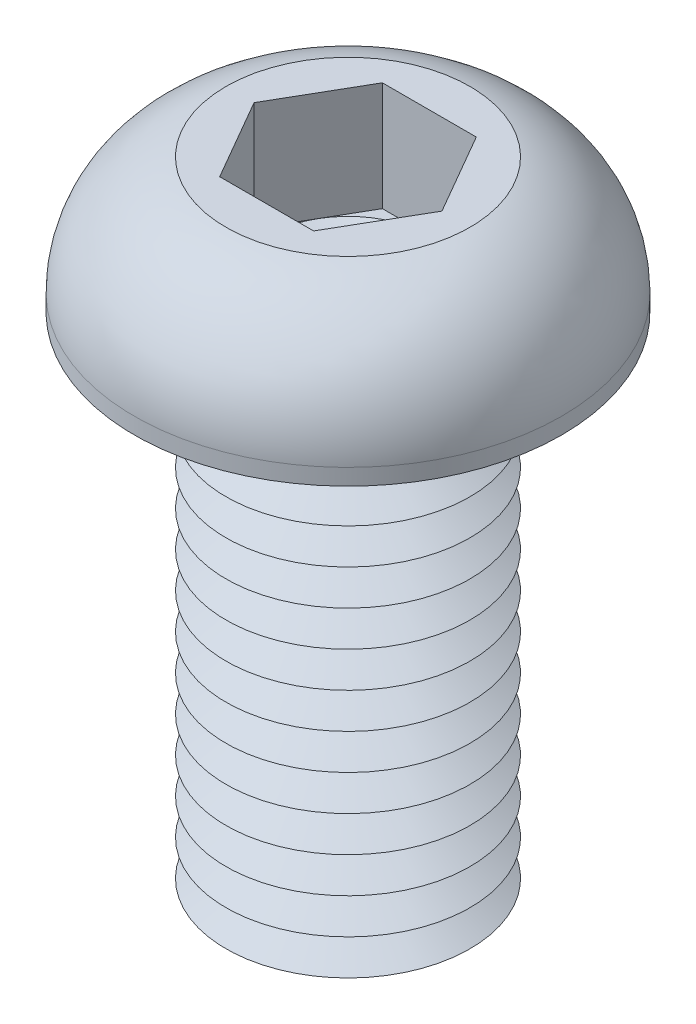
ISO-10303-21;
HEADER;
FILE_DESCRIPTION(('STEP AP214'),'2;1');
FILE_NAME('part.step','',(''),(''),'','','');
FILE_SCHEMA(('AUTOMOTIVE_DESIGN { 1 0 10303 214 1 1 1 1 }'));
ENDSEC;
DATA;
#1=APPLICATION_CONTEXT('core data for automotive mechanical design processes');
#2=APPLICATION_PROTOCOL_DEFINITION('international standard','automotive_design',2000,#1);
#3=PRODUCT_CONTEXT('',#1,'mechanical');
#4=PRODUCT('Part','Part','',(#3));
#5=PRODUCT_RELATED_PRODUCT_CATEGORY('part','',(#4));
#6=PRODUCT_DEFINITION_FORMATION('','',#4);
#7=PRODUCT_DEFINITION_CONTEXT('part definition',#1,'design');
#8=PRODUCT_DEFINITION('design','',#6,#7);
#9=PRODUCT_DEFINITION_SHAPE('','',#8);
#10=(LENGTH_UNIT() NAMED_UNIT(*) SI_UNIT(.MILLI.,.METRE.));
#11=(NAMED_UNIT(*) PLANE_ANGLE_UNIT() SI_UNIT($,.RADIAN.));
#12=(NAMED_UNIT(*) SI_UNIT($,.STERADIAN.) SOLID_ANGLE_UNIT());
#13=UNCERTAINTY_MEASURE_WITH_UNIT(LENGTH_MEASURE(1.E-05),#10,'distance_accuracy_value','');
#14=(GEOMETRIC_REPRESENTATION_CONTEXT(3) GLOBAL_UNCERTAINTY_ASSIGNED_CONTEXT((#13)) GLOBAL_UNIT_ASSIGNED_CONTEXT((#10,
#11,#12)) REPRESENTATION_CONTEXT('',''));
#15=CARTESIAN_POINT('',(0.,0.,0.));
#16=DIRECTION('',(0.,0.,1.));
#17=DIRECTION('',(1.,0.,0.));
#18=AXIS2_PLACEMENT_3D('',#15,#16,#17);
#19=CARTESIAN_POINT('',(0.,0.,0.));
#20=DIRECTION('',(0.,-1.,0.));
#21=DIRECTION('',(0.,0.,-1.));
#22=AXIS2_PLACEMENT_3D('',#19,#20,#21);
#23=TOROIDAL_SURFACE('',#22,6.875,0.875);
#24=CARTESIAN_POINT('',(0.,0.,-7.75));
#25=VERTEX_POINT('',#24);
#26=VERTEX_LOOP('',#25);
#27=FACE_BOUND('',#26,.T.);
#28=ADVANCED_FACE('P0_F12',(#27),#23,.T.);
#29=CLOSED_SHELL('',(#28));
#30=MANIFOLD_SOLID_BREP('P0_B1',#29);
#31=CARTESIAN_POINT('',(2.3094010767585,1.24,-4.));
#32=DIRECTION('',(0.,1.,0.));
#33=DIRECTION('',(0.,0.,1.));
#34=AXIS2_PLACEMENT_3D('',#31,#32,#33);
#35=PLANE('',#34);
#36=CARTESIAN_POINT('',(0.,1.24,0.));
#37=DIRECTION('',(0.,1.,0.));
#38=DIRECTION('',(0.,0.,1.));
#39=AXIS2_PLACEMENT_3D('',#36,#37,#38);
#40=CIRCLE('',#39,4.);
#41=CARTESIAN_POINT('',(0.,1.24,4.));
#42=VERTEX_POINT('',#41);
#43=CARTESIAN_POINT('',(3.46410161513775,1.24,2.));
#44=VERTEX_POINT('',#43);
#45=EDGE_CURVE('P1_E93',#42,#44,#40,.T.);
#46=ORIENTED_EDGE('',*,*,#45,.F.);
#47=DIRECTION('',(1.,0.,0.));
#48=VECTOR('',#47,1.);
#49=CARTESIAN_POINT('',(-2.3094010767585,1.24,4.));
#50=LINE('',#49,#48);
#51=CARTESIAN_POINT('',(2.3094010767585,1.24,4.));
#52=VERTEX_POINT('',#51);
#53=EDGE_CURVE('P1_E116',#42,#52,#50,.T.);
#54=ORIENTED_EDGE('',*,*,#53,.T.);
#55=DIRECTION('',(0.5,0.,-0.866025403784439));
#56=VECTOR('',#55,1.);
#57=CARTESIAN_POINT('',(2.3094010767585,1.24,4.));
#58=LINE('',#57,#56);
#59=EDGE_CURVE('P1_E112',#52,#44,#58,.T.);
#60=ORIENTED_EDGE('',*,*,#59,.T.);
#61=EDGE_LOOP('',(#46,#54,#60));
#62=FACE_BOUND('',#61,.T.);
#63=ADVANCED_FACE('P1_F15',(#62),#35,.T.);
#64=CARTESIAN_POINT('',(0.,1.24,0.));
#65=DIRECTION('',(0.,1.,0.));
#66=DIRECTION('',(0.,0.,1.));
#67=AXIS2_PLACEMENT_3D('',#64,#65,#66);
#68=CIRCLE('',#67,4.);
#69=CARTESIAN_POINT('',(3.46410161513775,1.24,-2.));
#70=VERTEX_POINT('',#69);
#71=EDGE_CURVE('P1_E10',#44,#70,#68,.T.);
#72=ORIENTED_EDGE('',*,*,#71,.F.);
#73=CARTESIAN_POINT('',(4.61880215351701,1.24,0.));
#74=VERTEX_POINT('',#73);
#75=EDGE_CURVE('P1_E104',#44,#74,#58,.T.);
#76=ORIENTED_EDGE('',*,*,#75,.T.);
#77=DIRECTION('',(-0.5,0.,-0.866025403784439));
#78=VECTOR('',#77,1.);
#79=CARTESIAN_POINT('',(4.61880215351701,1.24,0.));
#80=LINE('',#79,#78);
#81=EDGE_CURVE('P1_E107',#74,#70,#80,.T.);
#82=ORIENTED_EDGE('',*,*,#81,.T.);
#83=EDGE_LOOP('',(#72,#76,#82));
#84=FACE_BOUND('',#83,.T.);
#85=ADVANCED_FACE('P1_F103',(#84),#35,.T.);
#86=CARTESIAN_POINT('',(0.,1.24,-4.));
#87=VERTEX_POINT('',#86);
#88=EDGE_CURVE('P1_E24',#70,#87,#68,.T.);
#89=ORIENTED_EDGE('',*,*,#88,.F.);
#90=CARTESIAN_POINT('',(2.3094010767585,1.24,-4.));
#91=VERTEX_POINT('',#90);
#92=EDGE_CURVE('P1_E139',#70,#91,#80,.T.);
#93=ORIENTED_EDGE('',*,*,#92,.T.);
#94=DIRECTION('',(-1.,0.,0.));
#95=VECTOR('',#94,1.);
#96=CARTESIAN_POINT('',(2.3094010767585,1.24,-4.));
#97=LINE('',#96,#95);
#98=EDGE_CURVE('P1_E300',#91,#87,#97,.T.);
#99=ORIENTED_EDGE('',*,*,#98,.T.);
#100=EDGE_LOOP('',(#89,#93,#99));
#101=FACE_BOUND('',#100,.T.);
#102=ADVANCED_FACE('P1_F265',(#101),#35,.T.);
#103=CARTESIAN_POINT('',(-3.46410161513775,1.24,-2.));
#104=VERTEX_POINT('',#103);
#105=EDGE_CURVE('P1_E295',#87,#104,#68,.T.);
#106=ORIENTED_EDGE('',*,*,#105,.F.);
#107=CARTESIAN_POINT('',(-2.3094010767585,1.24,-4.));
#108=VERTEX_POINT('',#107);
#109=EDGE_CURVE('P1_E304',#87,#108,#97,.T.);
#110=ORIENTED_EDGE('',*,*,#109,.T.);
#111=DIRECTION('',(-0.5,0.,0.866025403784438));
#112=VECTOR('',#111,1.);
#113=CARTESIAN_POINT('',(-2.3094010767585,1.24,-4.));
#114=LINE('',#113,#112);
#115=EDGE_CURVE('P1_E299',#108,#104,#114,.T.);
#116=ORIENTED_EDGE('',*,*,#115,.T.);
#117=EDGE_LOOP('',(#106,#110,#116));
#118=FACE_BOUND('',#117,.T.);
#119=ADVANCED_FACE('P1_F279',(#118),#35,.T.);
#120=CARTESIAN_POINT('',(-3.46410161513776,1.24,2.));
#121=VERTEX_POINT('',#120);
#122=EDGE_CURVE('P1_E31',#104,#121,#68,.T.);
#123=ORIENTED_EDGE('',*,*,#122,.F.);
#124=CARTESIAN_POINT('',(-4.61880215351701,1.24,0.));
#125=VERTEX_POINT('',#124);
#126=EDGE_CURVE('P1_E291',#104,#125,#114,.T.);
#127=ORIENTED_EDGE('',*,*,#126,.T.);
#128=DIRECTION('',(0.5,0.,0.866025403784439));
#129=VECTOR('',#128,1.);
#130=CARTESIAN_POINT('',(-4.61880215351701,1.24,0.));
#131=LINE('',#130,#129);
#132=EDGE_CURVE('P1_E294',#125,#121,#131,.T.);
#133=ORIENTED_EDGE('',*,*,#132,.T.);
#134=EDGE_LOOP('',(#123,#127,#133));
#135=FACE_BOUND('',#134,.T.);
#136=ADVANCED_FACE('P1_F270',(#135),#35,.T.);
#137=CARTESIAN_POINT('',(0.,-23.25,0.));
#138=DIRECTION('',(0.,1.,0.));
#139=DIRECTION('',(0.,0.,1.));
#140=AXIS2_PLACEMENT_3D('',#137,#138,#139);
#141=CONICAL_SURFACE('',#140,4.48445554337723,1.0471975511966);
#142=CARTESIAN_POINT('',(0.,-22.375,0.));
#143=DIRECTION('',(0.,-1.,0.));
#144=DIRECTION('',(0.,0.,-1.));
#145=AXIS2_PLACEMENT_3D('',#142,#143,#144);
#146=CIRCLE('',#145,6.);
#147=CARTESIAN_POINT('',(0.,-22.375,-6.));
#148=VERTEX_POINT('',#147);
#149=EDGE_CURVE('P1_E227',#148,#148,#146,.T.);
#150=ORIENTED_EDGE('',*,*,#149,.T.);
#151=EDGE_LOOP('',(#150));
#152=FACE_BOUND('',#151,.T.);
#153=CARTESIAN_POINT('',(0.,-23.25,0.));
#154=DIRECTION('',(0.,-1.,0.));
#155=DIRECTION('',(0.,0.,-1.));
#156=AXIS2_PLACEMENT_3D('',#153,#154,#155);
#157=CIRCLE('',#156,4.48445554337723);
#158=CARTESIAN_POINT('',(0.,-23.25,-4.48445554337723));
#159=VERTEX_POINT('',#158);
#160=EDGE_CURVE('P1_E230',#159,#159,#157,.T.);
#161=ORIENTED_EDGE('',*,*,#160,.F.);
#162=EDGE_LOOP('',(#161));
#163=FACE_BOUND('',#162,.T.);
#164=ADVANCED_FACE('P1_F278',(#152,#163),#141,.T.);
#165=CARTESIAN_POINT('',(0.,-24.125,0.));
#166=DIRECTION('',(0.,-1.,0.));
#167=DIRECTION('',(0.,0.,-1.));
#168=AXIS2_PLACEMENT_3D('',#165,#166,#167);
#169=CONICAL_SURFACE('',#168,6.,1.0471975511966);
#170=ORIENTED_EDGE('',*,*,#160,.T.);
#171=EDGE_LOOP('',(#170));
#172=FACE_BOUND('',#171,.T.);
#173=CARTESIAN_POINT('',(0.,-24.125,0.));
#174=DIRECTION('',(0.,-1.,0.));
#175=DIRECTION('',(0.,0.,-1.));
#176=AXIS2_PLACEMENT_3D('',#173,#174,#175);
#177=CIRCLE('',#176,6.);
#178=CARTESIAN_POINT('',(0.,-24.125,-6.));
#179=VERTEX_POINT('',#178);
#180=EDGE_CURVE('P1_E233',#179,#179,#177,.T.);
#181=ORIENTED_EDGE('',*,*,#180,.F.);
#182=EDGE_LOOP('',(#181));
#183=FACE_BOUND('',#182,.T.);
#184=ADVANCED_FACE('P1_F285',(#172,#183),#169,.T.);
#185=CARTESIAN_POINT('',(0.,-25.,0.));
#186=DIRECTION('',(0.,1.,0.));
#187=DIRECTION('',(0.,0.,1.));
#188=AXIS2_PLACEMENT_3D('',#185,#186,#187);
#189=PLANE('',#188);
#190=CARTESIAN_POINT('',(0.,-25.,0.));
#191=DIRECTION('',(0.,-1.,0.));
#192=DIRECTION('',(0.,0.,-1.));
#193=AXIS2_PLACEMENT_3D('',#190,#191,#192);
#194=CIRCLE('',#193,4.48445554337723);
#195=CARTESIAN_POINT('',(0.,-25.,-4.48445554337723));
#196=VERTEX_POINT('',#195);
#197=EDGE_CURVE('P1_E236',#196,#196,#194,.T.);
#198=ORIENTED_EDGE('',*,*,#197,.T.);
#199=EDGE_LOOP('',(#198));
#200=FACE_BOUND('',#199,.T.);
#201=ADVANCED_FACE('P1_F363',(#200),#189,.F.);
#202=CARTESIAN_POINT('',(0.,-25.,0.));
#203=DIRECTION('',(0.,1.,0.));
#204=DIRECTION('',(0.,0.,1.));
#205=AXIS2_PLACEMENT_3D('',#202,#203,#204);
#206=CONICAL_SURFACE('',#205,4.48445554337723,1.0471975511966);
#207=ORIENTED_EDGE('',*,*,#180,.T.);
#208=EDGE_LOOP('',(#207));
#209=FACE_BOUND('',#208,.T.);
#210=ORIENTED_EDGE('',*,*,#197,.F.);
#211=EDGE_LOOP('',(#210));
#212=FACE_BOUND('',#211,.T.);
#213=ADVANCED_FACE('P1_F374',(#209,#212),#206,.T.);
#214=CARTESIAN_POINT('',(0.,-21.5,0.));
#215=DIRECTION('',(0.,1.,0.));
#216=DIRECTION('',(0.,0.,1.));
#217=AXIS2_PLACEMENT_3D('',#214,#215,#216);
#218=CONICAL_SURFACE('',#217,4.48445554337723,1.0471975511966);
#219=CARTESIAN_POINT('',(0.,-20.625,0.));
#220=DIRECTION('',(0.,-1.,0.));
#221=DIRECTION('',(0.,0.,-1.));
#222=AXIS2_PLACEMENT_3D('',#219,#220,#221);
#223=CIRCLE('',#222,6.);
#224=CARTESIAN_POINT('',(0.,-20.625,-6.));
#225=VERTEX_POINT('',#224);
#226=EDGE_CURVE('P1_E221',#225,#225,#223,.T.);
#227=ORIENTED_EDGE('',*,*,#226,.T.);
#228=EDGE_LOOP('',(#227));
#229=FACE_BOUND('',#228,.T.);
#230=CARTESIAN_POINT('',(0.,-21.5,0.));
#231=DIRECTION('',(0.,-1.,0.));
#232=DIRECTION('',(0.,0.,-1.));
#233=AXIS2_PLACEMENT_3D('',#230,#231,#232);
#234=CIRCLE('',#233,4.48445554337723);
#235=CARTESIAN_POINT('',(0.,-21.5,-4.48445554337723));
#236=VERTEX_POINT('',#235);
#237=EDGE_CURVE('P1_E224',#236,#236,#234,.T.);
#238=ORIENTED_EDGE('',*,*,#237,.F.);
#239=EDGE_LOOP('',(#238));
#240=FACE_BOUND('',#239,.T.);
#241=ADVANCED_FACE('P1_F383',(#229,#240),#218,.T.);
#242=CARTESIAN_POINT('',(0.,-22.375,0.));
#243=DIRECTION('',(0.,-1.,0.));
#244=DIRECTION('',(0.,0.,-1.));
#245=AXIS2_PLACEMENT_3D('',#242,#243,#244);
#246=CONICAL_SURFACE('',#245,6.,1.0471975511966);
#247=ORIENTED_EDGE('',*,*,#237,.T.);
#248=EDGE_LOOP('',(#247));
#249=FACE_BOUND('',#248,.T.);
#250=ORIENTED_EDGE('',*,*,#149,.F.);
#251=EDGE_LOOP('',(#250));
#252=FACE_BOUND('',#251,.T.);
#253=ADVANCED_FACE('P1_F392',(#249,#252),#246,.T.);
#254=CARTESIAN_POINT('',(0.,-19.75,0.));
#255=DIRECTION('',(0.,1.,0.));
#256=DIRECTION('',(0.,0.,1.));
#257=AXIS2_PLACEMENT_3D('',#254,#255,#256);
#258=CONICAL_SURFACE('',#257,4.48445554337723,1.0471975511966);
#259=CARTESIAN_POINT('',(0.,-18.875,0.));
#260=DIRECTION('',(0.,-1.,0.));
#261=DIRECTION('',(0.,0.,-1.));
#262=AXIS2_PLACEMENT_3D('',#259,#260,#261);
#263=CIRCLE('',#262,6.);
#264=CARTESIAN_POINT('',(0.,-18.875,-6.));
#265=VERTEX_POINT('',#264);
#266=EDGE_CURVE('P1_E215',#265,#265,#263,.T.);
#267=ORIENTED_EDGE('',*,*,#266,.T.);
#268=EDGE_LOOP('',(#267));
#269=FACE_BOUND('',#268,.T.);
#270=CARTESIAN_POINT('',(0.,-19.75,0.));
#271=DIRECTION('',(0.,-1.,0.));
#272=DIRECTION('',(0.,0.,-1.));
#273=AXIS2_PLACEMENT_3D('',#270,#271,#272);
#274=CIRCLE('',#273,4.48445554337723);
#275=CARTESIAN_POINT('',(0.,-19.75,-4.48445554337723));
#276=VERTEX_POINT('',#275);
#277=EDGE_CURVE('P1_E218',#276,#276,#274,.T.);
#278=ORIENTED_EDGE('',*,*,#277,.F.);
#279=EDGE_LOOP('',(#278));
#280=FACE_BOUND('',#279,.T.);
#281=ADVANCED_FACE('P1_F402',(#269,#280),#258,.T.);
#282=CARTESIAN_POINT('',(0.,-20.625,0.));
#283=DIRECTION('',(0.,-1.,0.));
#284=DIRECTION('',(0.,0.,-1.));
#285=AXIS2_PLACEMENT_3D('',#282,#283,#284);
#286=CONICAL_SURFACE('',#285,6.,1.0471975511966);
#287=ORIENTED_EDGE('',*,*,#277,.T.);
#288=EDGE_LOOP('',(#287));
#289=FACE_BOUND('',#288,.T.);
#290=ORIENTED_EDGE('',*,*,#226,.F.);
#291=EDGE_LOOP('',(#290));
#292=FACE_BOUND('',#291,.T.);
#293=ADVANCED_FACE('P1_F412',(#289,#292),#286,.T.);
#294=CARTESIAN_POINT('',(0.,-18.,0.));
#295=DIRECTION('',(0.,1.,0.));
#296=DIRECTION('',(0.,0.,1.));
#297=AXIS2_PLACEMENT_3D('',#294,#295,#296);
#298=CONICAL_SURFACE('',#297,4.48445554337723,1.0471975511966);
#299=CARTESIAN_POINT('',(0.,-17.125,0.));
#300=DIRECTION('',(0.,-1.,0.));
#301=DIRECTION('',(0.,0.,-1.));
#302=AXIS2_PLACEMENT_3D('',#299,#300,#301);
#303=CIRCLE('',#302,6.);
#304=CARTESIAN_POINT('',(0.,-17.125,-6.));
#305=VERTEX_POINT('',#304);
#306=EDGE_CURVE('P1_E209',#305,#305,#303,.T.);
#307=ORIENTED_EDGE('',*,*,#306,.T.);
#308=EDGE_LOOP('',(#307));
#309=FACE_BOUND('',#308,.T.);
#310=CARTESIAN_POINT('',(0.,-18.,0.));
#311=DIRECTION('',(0.,-1.,0.));
#312=DIRECTION('',(0.,0.,-1.));
#313=AXIS2_PLACEMENT_3D('',#310,#311,#312);
#314=CIRCLE('',#313,4.48445554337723);
#315=CARTESIAN_POINT('',(0.,-18.,-4.48445554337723));
#316=VERTEX_POINT('',#315);
#317=EDGE_CURVE('P1_E212',#316,#316,#314,.T.);
#318=ORIENTED_EDGE('',*,*,#317,.F.);
#319=EDGE_LOOP('',(#318));
#320=FACE_BOUND('',#319,.T.);
#321=ADVANCED_FACE('P1_F422',(#309,#320),#298,.T.);
#322=CARTESIAN_POINT('',(0.,-18.875,0.));
#323=DIRECTION('',(0.,-1.,0.));
#324=DIRECTION('',(0.,0.,-1.));
#325=AXIS2_PLACEMENT_3D('',#322,#323,#324);
#326=CONICAL_SURFACE('',#325,6.,1.0471975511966);
#327=ORIENTED_EDGE('',*,*,#317,.T.);
#328=EDGE_LOOP('',(#327));
#329=FACE_BOUND('',#328,.T.);
#330=ORIENTED_EDGE('',*,*,#266,.F.);
#331=EDGE_LOOP('',(#330));
#332=FACE_BOUND('',#331,.T.);
#333=ADVANCED_FACE('P1_F432',(#329,#332),#326,.T.);
#334=CARTESIAN_POINT('',(0.,-16.25,0.));
#335=DIRECTION('',(0.,1.,0.));
#336=DIRECTION('',(0.,0.,1.));
#337=AXIS2_PLACEMENT_3D('',#334,#335,#336);
#338=CONICAL_SURFACE('',#337,4.48445554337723,1.0471975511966);
#339=CARTESIAN_POINT('',(0.,-15.375,0.));
#340=DIRECTION('',(0.,-1.,0.));
#341=DIRECTION('',(0.,0.,-1.));
#342=AXIS2_PLACEMENT_3D('',#339,#340,#341);
#343=CIRCLE('',#342,6.);
#344=CARTESIAN_POINT('',(0.,-15.375,-6.));
#345=VERTEX_POINT('',#344);
#346=EDGE_CURVE('P1_E203',#345,#345,#343,.T.);
#347=ORIENTED_EDGE('',*,*,#346,.T.);
#348=EDGE_LOOP('',(#347));
#349=FACE_BOUND('',#348,.T.);
#350=CARTESIAN_POINT('',(0.,-16.25,0.));
#351=DIRECTION('',(0.,-1.,0.));
#352=DIRECTION('',(0.,0.,-1.));
#353=AXIS2_PLACEMENT_3D('',#350,#351,#352);
#354=CIRCLE('',#353,4.48445554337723);
#355=CARTESIAN_POINT('',(0.,-16.25,-4.48445554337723));
#356=VERTEX_POINT('',#355);
#357=EDGE_CURVE('P1_E206',#356,#356,#354,.T.);
#358=ORIENTED_EDGE('',*,*,#357,.F.);
#359=EDGE_LOOP('',(#358));
#360=FACE_BOUND('',#359,.T.);
#361=ADVANCED_FACE('P1_F442',(#349,#360),#338,.T.);
#362=CARTESIAN_POINT('',(0.,-17.125,0.));
#363=DIRECTION('',(0.,-1.,0.));
#364=DIRECTION('',(0.,0.,-1.));
#365=AXIS2_PLACEMENT_3D('',#362,#363,#364);
#366=CONICAL_SURFACE('',#365,6.,1.0471975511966);
#367=ORIENTED_EDGE('',*,*,#357,.T.);
#368=EDGE_LOOP('',(#367));
#369=FACE_BOUND('',#368,.T.);
#370=ORIENTED_EDGE('',*,*,#306,.F.);
#371=EDGE_LOOP('',(#370));
#372=FACE_BOUND('',#371,.T.);
#373=ADVANCED_FACE('P1_F452',(#369,#372),#366,.T.);
#374=CARTESIAN_POINT('',(0.,-14.5,0.));
#375=DIRECTION('',(0.,1.,0.));
#376=DIRECTION('',(0.,0.,1.));
#377=AXIS2_PLACEMENT_3D('',#374,#375,#376);
#378=CONICAL_SURFACE('',#377,4.48445554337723,1.0471975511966);
#379=CARTESIAN_POINT('',(0.,-13.625,0.));
#380=DIRECTION('',(0.,-1.,0.));
#381=DIRECTION('',(0.,0.,-1.));
#382=AXIS2_PLACEMENT_3D('',#379,#380,#381);
#383=CIRCLE('',#382,6.);
#384=CARTESIAN_POINT('',(0.,-13.625,-6.));
#385=VERTEX_POINT('',#384);
#386=EDGE_CURVE('P1_E197',#385,#385,#383,.T.);
#387=ORIENTED_EDGE('',*,*,#386,.T.);
#388=EDGE_LOOP('',(#387));
#389=FACE_BOUND('',#388,.T.);
#390=CARTESIAN_POINT('',(0.,-14.5,0.));
#391=DIRECTION('',(0.,-1.,0.));
#392=DIRECTION('',(0.,0.,-1.));
#393=AXIS2_PLACEMENT_3D('',#390,#391,#392);
#394=CIRCLE('',#393,4.48445554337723);
#395=CARTESIAN_POINT('',(0.,-14.5,-4.48445554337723));
#396=VERTEX_POINT('',#395);
#397=EDGE_CURVE('P1_E200',#396,#396,#394,.T.);
#398=ORIENTED_EDGE('',*,*,#397,.F.);
#399=EDGE_LOOP('',(#398));
#400=FACE_BOUND('',#399,.T.);
#401=ADVANCED_FACE('P1_F462',(#389,#400),#378,.T.);
#402=CARTESIAN_POINT('',(0.,-15.375,0.));
#403=DIRECTION('',(0.,-1.,0.));
#404=DIRECTION('',(0.,0.,-1.));
#405=AXIS2_PLACEMENT_3D('',#402,#403,#404);
#406=CONICAL_SURFACE('',#405,6.,1.0471975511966);
#407=ORIENTED_EDGE('',*,*,#397,.T.);
#408=EDGE_LOOP('',(#407));
#409=FACE_BOUND('',#408,.T.);
#410=ORIENTED_EDGE('',*,*,#346,.F.);
#411=EDGE_LOOP('',(#410));
#412=FACE_BOUND('',#411,.T.);
#413=ADVANCED_FACE('P1_F472',(#409,#412),#406,.T.);
#414=CARTESIAN_POINT('',(0.,-12.75,0.));
#415=DIRECTION('',(0.,1.,0.));
#416=DIRECTION('',(0.,0.,1.));
#417=AXIS2_PLACEMENT_3D('',#414,#415,#416);
#418=CONICAL_SURFACE('',#417,4.48445554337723,1.0471975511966);
#419=CARTESIAN_POINT('',(0.,-11.875,0.));
#420=DIRECTION('',(0.,-1.,0.));
#421=DIRECTION('',(0.,0.,-1.));
#422=AXIS2_PLACEMENT_3D('',#419,#420,#421);
#423=CIRCLE('',#422,6.);
#424=CARTESIAN_POINT('',(0.,-11.875,-6.));
#425=VERTEX_POINT('',#424);
#426=EDGE_CURVE('P1_E191',#425,#425,#423,.T.);
#427=ORIENTED_EDGE('',*,*,#426,.T.);
#428=EDGE_LOOP('',(#427));
#429=FACE_BOUND('',#428,.T.);
#430=CARTESIAN_POINT('',(0.,-12.75,0.));
#431=DIRECTION('',(0.,-1.,0.));
#432=DIRECTION('',(0.,0.,-1.));
#433=AXIS2_PLACEMENT_3D('',#430,#431,#432);
#434=CIRCLE('',#433,4.48445554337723);
#435=CARTESIAN_POINT('',(0.,-12.75,-4.48445554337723));
#436=VERTEX_POINT('',#435);
#437=EDGE_CURVE('P1_E194',#436,#436,#434,.T.);
#438=ORIENTED_EDGE('',*,*,#437,.F.);
#439=EDGE_LOOP('',(#438));
#440=FACE_BOUND('',#439,.T.);
#441=ADVANCED_FACE('P1_F482',(#429,#440),#418,.T.);
#442=CARTESIAN_POINT('',(0.,-13.625,0.));
#443=DIRECTION('',(0.,-1.,0.));
#444=DIRECTION('',(0.,0.,-1.));
#445=AXIS2_PLACEMENT_3D('',#442,#443,#444);
#446=CONICAL_SURFACE('',#445,6.,1.0471975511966);
#447=ORIENTED_EDGE('',*,*,#437,.T.);
#448=EDGE_LOOP('',(#447));
#449=FACE_BOUND('',#448,.T.);
#450=ORIENTED_EDGE('',*,*,#386,.F.);
#451=EDGE_LOOP('',(#450));
#452=FACE_BOUND('',#451,.T.);
#453=ADVANCED_FACE('P1_F492',(#449,#452),#446,.T.);
#454=CARTESIAN_POINT('',(0.,-11.,0.));
#455=DIRECTION('',(0.,1.,0.));
#456=DIRECTION('',(0.,0.,1.));
#457=AXIS2_PLACEMENT_3D('',#454,#455,#456);
#458=CONICAL_SURFACE('',#457,4.48445554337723,1.0471975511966);
#459=CARTESIAN_POINT('',(0.,-10.125,0.));
#460=DIRECTION('',(0.,-1.,0.));
#461=DIRECTION('',(0.,0.,-1.));
#462=AXIS2_PLACEMENT_3D('',#459,#460,#461);
#463=CIRCLE('',#462,6.);
#464=CARTESIAN_POINT('',(0.,-10.125,-6.));
#465=VERTEX_POINT('',#464);
#466=EDGE_CURVE('P1_E185',#465,#465,#463,.T.);
#467=ORIENTED_EDGE('',*,*,#466,.T.);
#468=EDGE_LOOP('',(#467));
#469=FACE_BOUND('',#468,.T.);
#470=CARTESIAN_POINT('',(0.,-11.,0.));
#471=DIRECTION('',(0.,-1.,0.));
#472=DIRECTION('',(0.,0.,-1.));
#473=AXIS2_PLACEMENT_3D('',#470,#471,#472);
#474=CIRCLE('',#473,4.48445554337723);
#475=CARTESIAN_POINT('',(0.,-11.,-4.48445554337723));
#476=VERTEX_POINT('',#475);
#477=EDGE_CURVE('P1_E188',#476,#476,#474,.T.);
#478=ORIENTED_EDGE('',*,*,#477,.F.);
#479=EDGE_LOOP('',(#478));
#480=FACE_BOUND('',#479,.T.);
#481=ADVANCED_FACE('P1_F502',(#469,#480),#458,.T.);
#482=CARTESIAN_POINT('',(0.,-11.875,0.));
#483=DIRECTION('',(0.,-1.,0.));
#484=DIRECTION('',(0.,0.,-1.));
#485=AXIS2_PLACEMENT_3D('',#482,#483,#484);
#486=CONICAL_SURFACE('',#485,6.,1.0471975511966);
#487=ORIENTED_EDGE('',*,*,#477,.T.);
#488=EDGE_LOOP('',(#487));
#489=FACE_BOUND('',#488,.T.);
#490=ORIENTED_EDGE('',*,*,#426,.F.);
#491=EDGE_LOOP('',(#490));
#492=FACE_BOUND('',#491,.T.);
#493=ADVANCED_FACE('P1_F512',(#489,#492),#486,.T.);
#494=CARTESIAN_POINT('',(0.,-9.25,0.));
#495=DIRECTION('',(0.,1.,0.));
#496=DIRECTION('',(0.,0.,1.));
#497=AXIS2_PLACEMENT_3D('',#494,#495,#496);
#498=CONICAL_SURFACE('',#497,4.48445554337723,1.0471975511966);
#499=CARTESIAN_POINT('',(0.,-8.375,0.));
#500=DIRECTION('',(0.,-1.,0.));
#501=DIRECTION('',(0.,0.,-1.));
#502=AXIS2_PLACEMENT_3D('',#499,#500,#501);
#503=CIRCLE('',#502,6.);
#504=CARTESIAN_POINT('',(0.,-8.375,-6.));
#505=VERTEX_POINT('',#504);
#506=EDGE_CURVE('P1_E179',#505,#505,#503,.T.);
#507=ORIENTED_EDGE('',*,*,#506,.T.);
#508=EDGE_LOOP('',(#507));
#509=FACE_BOUND('',#508,.T.);
#510=CARTESIAN_POINT('',(0.,-9.25,0.));
#511=DIRECTION('',(0.,-1.,0.));
#512=DIRECTION('',(0.,0.,-1.));
#513=AXIS2_PLACEMENT_3D('',#510,#511,#512);
#514=CIRCLE('',#513,4.48445554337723);
#515=CARTESIAN_POINT('',(0.,-9.25,-4.48445554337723));
#516=VERTEX_POINT('',#515);
#517=EDGE_CURVE('P1_E182',#516,#516,#514,.T.);
#518=ORIENTED_EDGE('',*,*,#517,.F.);
#519=EDGE_LOOP('',(#518));
#520=FACE_BOUND('',#519,.T.);
#521=ADVANCED_FACE('P1_F522',(#509,#520),#498,.T.);
#522=CARTESIAN_POINT('',(0.,-10.125,0.));
#523=DIRECTION('',(0.,-1.,0.));
#524=DIRECTION('',(0.,0.,-1.));
#525=AXIS2_PLACEMENT_3D('',#522,#523,#524);
#526=CONICAL_SURFACE('',#525,6.,1.0471975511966);
#527=ORIENTED_EDGE('',*,*,#517,.T.);
#528=EDGE_LOOP('',(#527));
#529=FACE_BOUND('',#528,.T.);
#530=ORIENTED_EDGE('',*,*,#466,.F.);
#531=EDGE_LOOP('',(#530));
#532=FACE_BOUND('',#531,.T.);
#533=ADVANCED_FACE('P1_F532',(#529,#532),#526,.T.);
#534=CARTESIAN_POINT('',(0.,-7.5,0.));
#535=DIRECTION('',(0.,1.,0.));
#536=DIRECTION('',(0.,0.,1.));
#537=AXIS2_PLACEMENT_3D('',#534,#535,#536);
#538=CONICAL_SURFACE('',#537,4.48445554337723,1.0471975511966);
#539=CARTESIAN_POINT('',(0.,-6.625,0.));
#540=DIRECTION('',(0.,-1.,0.));
#541=DIRECTION('',(0.,0.,-1.));
#542=AXIS2_PLACEMENT_3D('',#539,#540,#541);
#543=CIRCLE('',#542,6.);
#544=CARTESIAN_POINT('',(0.,-6.625,-6.));
#545=VERTEX_POINT('',#544);
#546=EDGE_CURVE('P1_E173',#545,#545,#543,.T.);
#547=ORIENTED_EDGE('',*,*,#546,.T.);
#548=EDGE_LOOP('',(#547));
#549=FACE_BOUND('',#548,.T.);
#550=CARTESIAN_POINT('',(0.,-7.5,0.));
#551=DIRECTION('',(0.,-1.,0.));
#552=DIRECTION('',(0.,0.,-1.));
#553=AXIS2_PLACEMENT_3D('',#550,#551,#552);
#554=CIRCLE('',#553,4.48445554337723);
#555=CARTESIAN_POINT('',(0.,-7.5,-4.48445554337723));
#556=VERTEX_POINT('',#555);
#557=EDGE_CURVE('P1_E176',#556,#556,#554,.T.);
#558=ORIENTED_EDGE('',*,*,#557,.F.);
#559=EDGE_LOOP('',(#558));
#560=FACE_BOUND('',#559,.T.);
#561=ADVANCED_FACE('P1_F542',(#549,#560),#538,.T.);
#562=CARTESIAN_POINT('',(0.,-8.375,0.));
#563=DIRECTION('',(0.,-1.,0.));
#564=DIRECTION('',(0.,0.,-1.));
#565=AXIS2_PLACEMENT_3D('',#562,#563,#564);
#566=CONICAL_SURFACE('',#565,6.,1.0471975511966);
#567=ORIENTED_EDGE('',*,*,#557,.T.);
#568=EDGE_LOOP('',(#567));
#569=FACE_BOUND('',#568,.T.);
#570=ORIENTED_EDGE('',*,*,#506,.F.);
#571=EDGE_LOOP('',(#570));
#572=FACE_BOUND('',#571,.T.);
#573=ADVANCED_FACE('P1_F552',(#569,#572),#566,.T.);
#574=CARTESIAN_POINT('',(0.,-5.75,0.));
#575=DIRECTION('',(0.,1.,0.));
#576=DIRECTION('',(0.,0.,1.));
#577=AXIS2_PLACEMENT_3D('',#574,#575,#576);
#578=CONICAL_SURFACE('',#577,4.48445554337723,1.0471975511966);
#579=CARTESIAN_POINT('',(0.,-4.875,0.));
#580=DIRECTION('',(0.,-1.,0.));
#581=DIRECTION('',(0.,0.,-1.));
#582=AXIS2_PLACEMENT_3D('',#579,#580,#581);
#583=CIRCLE('',#582,6.);
#584=CARTESIAN_POINT('',(0.,-4.875,-6.));
#585=VERTEX_POINT('',#584);
#586=EDGE_CURVE('P1_E164',#585,#585,#583,.T.);
#587=ORIENTED_EDGE('',*,*,#586,.T.);
#588=EDGE_LOOP('',(#587));
#589=FACE_BOUND('',#588,.T.);
#590=CARTESIAN_POINT('',(0.,-5.75,0.));
#591=DIRECTION('',(0.,-1.,0.));
#592=DIRECTION('',(0.,0.,-1.));
#593=AXIS2_PLACEMENT_3D('',#590,#591,#592);
#594=CIRCLE('',#593,4.48445554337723);
#595=CARTESIAN_POINT('',(0.,-5.75,-4.48445554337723));
#596=VERTEX_POINT('',#595);
#597=EDGE_CURVE('P1_E170',#596,#596,#594,.T.);
#598=ORIENTED_EDGE('',*,*,#597,.F.);
#599=EDGE_LOOP('',(#598));
#600=FACE_BOUND('',#599,.T.);
#601=ADVANCED_FACE('P1_F562',(#589,#600),#578,.T.);
#602=CARTESIAN_POINT('',(0.,-6.625,0.));
#603=DIRECTION('',(0.,-1.,0.));
#604=DIRECTION('',(0.,0.,-1.));
#605=AXIS2_PLACEMENT_3D('',#602,#603,#604);
#606=CONICAL_SURFACE('',#605,6.,1.0471975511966);
#607=ORIENTED_EDGE('',*,*,#597,.T.);
#608=EDGE_LOOP('',(#607));
#609=FACE_BOUND('',#608,.T.);
#610=ORIENTED_EDGE('',*,*,#546,.F.);
#611=EDGE_LOOP('',(#610));
#612=FACE_BOUND('',#611,.T.);
#613=ADVANCED_FACE('P1_F572',(#609,#612),#606,.T.);
#614=CARTESIAN_POINT('',(0.,-4.,0.));
#615=DIRECTION('',(0.,1.,0.));
#616=DIRECTION('',(0.,0.,1.));
#617=AXIS2_PLACEMENT_3D('',#614,#615,#616);
#618=CONICAL_SURFACE('',#617,4.48445554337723,1.0471975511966);
#619=CARTESIAN_POINT('',(0.,-3.125,0.));
#620=DIRECTION('',(0.,-1.,0.));
#621=DIRECTION('',(0.,0.,-1.));
#622=AXIS2_PLACEMENT_3D('',#619,#620,#621);
#623=CIRCLE('',#622,6.);
#624=CARTESIAN_POINT('',(0.,-3.125,-6.));
#625=VERTEX_POINT('',#624);
#626=EDGE_CURVE('P1_E167',#625,#625,#623,.T.);
#627=ORIENTED_EDGE('',*,*,#626,.T.);
#628=EDGE_LOOP('',(#627));
#629=FACE_BOUND('',#628,.T.);
#630=CARTESIAN_POINT('',(0.,-4.,0.));
#631=DIRECTION('',(0.,-1.,0.));
#632=DIRECTION('',(0.,0.,-1.));
#633=AXIS2_PLACEMENT_3D('',#630,#631,#632);
#634=CIRCLE('',#633,4.48445554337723);
#635=CARTESIAN_POINT('',(0.,-4.,-4.48445554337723));
#636=VERTEX_POINT('',#635);
#637=EDGE_CURVE('P1_E161',#636,#636,#634,.T.);
#638=ORIENTED_EDGE('',*,*,#637,.F.);
#639=EDGE_LOOP('',(#638));
#640=FACE_BOUND('',#639,.T.);
#641=ADVANCED_FACE('P1_F582',(#629,#640),#618,.T.);
#642=CARTESIAN_POINT('',(0.,-4.875,0.));
#643=DIRECTION('',(0.,-1.,0.));
#644=DIRECTION('',(0.,0.,-1.));
#645=AXIS2_PLACEMENT_3D('',#642,#643,#644);
#646=CONICAL_SURFACE('',#645,6.,1.0471975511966);
#647=ORIENTED_EDGE('',*,*,#637,.T.);
#648=EDGE_LOOP('',(#647));
#649=FACE_BOUND('',#648,.T.);
#650=ORIENTED_EDGE('',*,*,#586,.F.);
#651=EDGE_LOOP('',(#650));
#652=FACE_BOUND('',#651,.T.);
#653=ADVANCED_FACE('P1_F592',(#649,#652),#646,.T.);
#654=CARTESIAN_POINT('',(0.,-25.,0.));
#655=DIRECTION('',(0.,1.,0.));
#656=DIRECTION('',(0.,0.,1.));
#657=AXIS2_PLACEMENT_3D('',#654,#655,#656);
#658=CYLINDRICAL_SURFACE('',#657,6.);
#659=CARTESIAN_POINT('',(0.,0.,0.));
#660=DIRECTION('',(0.,-1.,0.));
#661=DIRECTION('',(1.,0.,0.));
#662=AXIS2_PLACEMENT_3D('',#659,#660,#661);
#663=CIRCLE('',#662,6.);
#664=CARTESIAN_POINT('',(6.,0.,0.));
#665=VERTEX_POINT('',#664);
#666=EDGE_CURVE('P1_E141',#665,#665,#663,.F.);
#667=ORIENTED_EDGE('',*,*,#666,.F.);
#668=EDGE_LOOP('',(#667));
#669=FACE_BOUND('',#668,.T.);
#670=ORIENTED_EDGE('',*,*,#626,.F.);
#671=EDGE_LOOP('',(#670));
#672=FACE_BOUND('',#671,.T.);
#673=ADVANCED_FACE('P1_F17',(#669,#672),#658,.T.);
#674=CARTESIAN_POINT('',(0.,0.,0.));
#675=DIRECTION('',(0.,-1.,0.));
#676=DIRECTION('',(0.,0.,-1.));
#677=AXIS2_PLACEMENT_3D('',#674,#675,#676);
#678=TOROIDAL_SURFACE('',#677,6.875,0.875);
#679=ORIENTED_EDGE('',*,*,#666,.T.);
#680=EDGE_LOOP('',(#679));
#681=FACE_BOUND('',#680,.T.);
#682=CARTESIAN_POINT('',(0.,0.,0.));
#683=DIRECTION('',(0.,1.,0.));
#684=DIRECTION('',(-1.,0.,0.));
#685=AXIS2_PLACEMENT_3D('',#682,#683,#684);
#686=CIRCLE('',#685,7.75);
#687=CARTESIAN_POINT('',(-7.75,0.,0.));
#688=VERTEX_POINT('',#687);
#689=EDGE_CURVE('P1_E151',#688,#688,#686,.F.);
#690=ORIENTED_EDGE('',*,*,#689,.T.);
#691=EDGE_LOOP('',(#690));
#692=FACE_BOUND('',#691,.T.);
#693=ADVANCED_FACE('P1_F241',(#681,#692),#678,.F.);
#694=CARTESIAN_POINT('',(6.,6.6,0.));
#695=DIRECTION('',(0.,-1.,0.));
#696=DIRECTION('',(1.,0.,0.));
#697=AXIS2_PLACEMENT_3D('',#694,#695,#696);
#698=PLANE('',#697);
#699=DIRECTION('',(-1.,0.,0.));
#700=VECTOR('',#699,1.);
#701=CARTESIAN_POINT('',(2.3094010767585,6.6,-4.));
#702=LINE('',#701,#700);
#703=CARTESIAN_POINT('',(2.3094010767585,6.6,-4.));
#704=VERTEX_POINT('',#703);
#705=CARTESIAN_POINT('',(-2.3094010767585,6.6,-4.));
#706=VERTEX_POINT('',#705);
#707=EDGE_CURVE('P1_E125',#704,#706,#702,.T.);
#708=ORIENTED_EDGE('',*,*,#707,.F.);
#709=DIRECTION('',(-0.5,0.,-0.866025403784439));
#710=VECTOR('',#709,1.);
#711=CARTESIAN_POINT('',(4.61880215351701,6.6,0.));
#712=LINE('',#711,#710);
#713=CARTESIAN_POINT('',(4.61880215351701,6.6,0.));
#714=VERTEX_POINT('',#713);
#715=EDGE_CURVE('P1_E39',#714,#704,#712,.T.);
#716=ORIENTED_EDGE('',*,*,#715,.F.);
#717=DIRECTION('',(0.5,0.,-0.866025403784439));
#718=VECTOR('',#717,1.);
#719=CARTESIAN_POINT('',(2.3094010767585,6.6,4.));
#720=LINE('',#719,#718);
#721=CARTESIAN_POINT('',(2.3094010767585,6.6,4.));
#722=VERTEX_POINT('',#721);
#723=EDGE_CURVE('P1_E137',#722,#714,#720,.T.);
#724=ORIENTED_EDGE('',*,*,#723,.F.);
#725=DIRECTION('',(1.,0.,0.));
#726=VECTOR('',#725,1.);
#727=CARTESIAN_POINT('',(-2.3094010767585,6.6,4.));
#728=LINE('',#727,#726);
#729=CARTESIAN_POINT('',(-2.3094010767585,6.6,4.));
#730=VERTEX_POINT('',#729);
#731=EDGE_CURVE('P1_E134',#730,#722,#728,.T.);
#732=ORIENTED_EDGE('',*,*,#731,.F.);
#733=DIRECTION('',(0.5,0.,0.866025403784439));
#734=VECTOR('',#733,1.);
#735=CARTESIAN_POINT('',(-4.61880215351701,6.6,0.));
#736=LINE('',#735,#734);
#737=CARTESIAN_POINT('',(-4.61880215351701,6.6,0.));
#738=VERTEX_POINT('',#737);
#739=EDGE_CURVE('P1_E131',#738,#730,#736,.T.);
#740=ORIENTED_EDGE('',*,*,#739,.F.);
#741=DIRECTION('',(-0.5,0.,0.866025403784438));
#742=VECTOR('',#741,1.);
#743=CARTESIAN_POINT('',(-2.3094010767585,6.6,-4.));
#744=LINE('',#743,#742);
#745=EDGE_CURVE('P1_E128',#706,#738,#744,.T.);
#746=ORIENTED_EDGE('',*,*,#745,.F.);
#747=EDGE_LOOP('',(#708,#716,#724,#732,#740,#746));
#748=FACE_BOUND('',#747,.T.);
#749=CARTESIAN_POINT('',(0.,6.6,0.));
#750=DIRECTION('',(0.,1.,0.));
#751=DIRECTION('',(-1.,0.,0.));
#752=AXIS2_PLACEMENT_3D('',#749,#750,#751);
#753=CIRCLE('',#752,6.);
#754=CARTESIAN_POINT('',(-6.,6.6,0.));
#755=VERTEX_POINT('',#754);
#756=EDGE_CURVE('P1_E152',#755,#755,#753,.T.);
#757=ORIENTED_EDGE('',*,*,#756,.T.);
#758=EDGE_LOOP('',(#757));
#759=FACE_BOUND('',#758,.T.);
#760=ADVANCED_FACE('P1_F319',(#748,#759),#698,.F.);
#761=CARTESIAN_POINT('',(0.,0.8,0.));
#762=DIRECTION('',(0.,1.,0.));
#763=DIRECTION('',(-1.,0.,0.));
#764=AXIS2_PLACEMENT_3D('',#761,#762,#763);
#765=DEGENERATE_TOROIDAL_SURFACE('',#764,4.51222222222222,5.98777777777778,.T.);
#766=ORIENTED_EDGE('',*,*,#756,.F.);
#767=EDGE_LOOP('',(#766));
#768=FACE_BOUND('',#767,.T.);
#769=CARTESIAN_POINT('',(0.,0.799999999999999,0.));
#770=DIRECTION('',(0.,1.,0.));
#771=DIRECTION('',(-1.,0.,0.));
#772=AXIS2_PLACEMENT_3D('',#769,#770,#771);
#773=CIRCLE('',#772,10.5);
#774=CARTESIAN_POINT('',(-10.5,0.799999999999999,0.));
#775=VERTEX_POINT('',#774);
#776=EDGE_CURVE('P1_E155',#775,#775,#773,.T.);
#777=ORIENTED_EDGE('',*,*,#776,.T.);
#778=EDGE_LOOP('',(#777));
#779=FACE_BOUND('',#778,.T.);
#780=ADVANCED_FACE('P1_F255',(#768,#779),#765,.T.);
#781=CARTESIAN_POINT('',(0.,6.6,0.));
#782=DIRECTION('',(0.,1.,0.));
#783=DIRECTION('',(-1.,0.,0.));
#784=AXIS2_PLACEMENT_3D('',#781,#782,#783);
#785=CYLINDRICAL_SURFACE('',#784,10.5);
#786=ORIENTED_EDGE('',*,*,#776,.F.);
#787=EDGE_LOOP('',(#786));
#788=FACE_BOUND('',#787,.T.);
#789=CARTESIAN_POINT('',(0.,0.,0.));
#790=DIRECTION('',(0.,1.,0.));
#791=DIRECTION('',(-1.,0.,0.));
#792=AXIS2_PLACEMENT_3D('',#789,#790,#791);
#793=CIRCLE('',#792,10.5);
#794=CARTESIAN_POINT('',(-10.5,0.,0.));
#795=VERTEX_POINT('',#794);
#796=EDGE_CURVE('P1_E158',#795,#795,#793,.T.);
#797=ORIENTED_EDGE('',*,*,#796,.T.);
#798=EDGE_LOOP('',(#797));
#799=FACE_BOUND('',#798,.T.);
#800=ADVANCED_FACE('P1_F246',(#788,#799),#785,.T.);
#801=CARTESIAN_POINT('',(0.,0.,0.));
#802=DIRECTION('',(0.,1.,0.));
#803=DIRECTION('',(-1.,0.,0.));
#804=AXIS2_PLACEMENT_3D('',#801,#802,#803);
#805=PLANE('',#804);
#806=ORIENTED_EDGE('',*,*,#796,.F.);
#807=EDGE_LOOP('',(#806));
#808=FACE_BOUND('',#807,.T.);
#809=ORIENTED_EDGE('',*,*,#689,.F.);
#810=EDGE_LOOP('',(#809));
#811=FACE_BOUND('',#810,.T.);
#812=ADVANCED_FACE('P1_F243',(#808,#811),#805,.F.);
#813=CARTESIAN_POINT('',(4.61880215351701,1.24,0.));
#814=DIRECTION('',(0.866025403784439,0.,-0.5));
#815=DIRECTION('',(-0.5,0.,-0.866025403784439));
#816=AXIS2_PLACEMENT_3D('',#813,#814,#815);
#817=PLANE('',#816);
#818=ORIENTED_EDGE('',*,*,#715,.T.);
#819=DIRECTION('',(0.,1.,0.));
#820=VECTOR('',#819,1.);
#821=CARTESIAN_POINT('',(2.3094010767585,1.24,-4.));
#822=LINE('',#821,#820);
#823=EDGE_CURVE('P1_E118',#91,#704,#822,.T.);
#824=ORIENTED_EDGE('',*,*,#823,.F.);
#825=ORIENTED_EDGE('',*,*,#92,.F.);
#826=ORIENTED_EDGE('',*,*,#81,.F.);
#827=DIRECTION('',(0.,1.,0.));
#828=VECTOR('',#827,1.);
#829=CARTESIAN_POINT('',(4.61880215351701,1.24,0.));
#830=LINE('',#829,#828);
#831=EDGE_CURVE('P1_E113',#74,#714,#830,.T.);
#832=ORIENTED_EDGE('',*,*,#831,.T.);
#833=EDGE_LOOP('',(#818,#824,#825,#826,#832));
#834=FACE_BOUND('',#833,.T.);
#835=ADVANCED_FACE('P1_F245',(#834),#817,.F.);
#836=CARTESIAN_POINT('',(2.3094010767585,1.24,4.));
#837=DIRECTION('',(0.866025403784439,0.,0.5));
#838=DIRECTION('',(0.5,0.,-0.866025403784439));
#839=AXIS2_PLACEMENT_3D('',#836,#837,#838);
#840=PLANE('',#839);
#841=ORIENTED_EDGE('',*,*,#723,.T.);
#842=ORIENTED_EDGE('',*,*,#831,.F.);
#843=ORIENTED_EDGE('',*,*,#75,.F.);
#844=ORIENTED_EDGE('',*,*,#59,.F.);
#845=DIRECTION('',(0.,1.,0.));
#846=VECTOR('',#845,1.);
#847=CARTESIAN_POINT('',(2.3094010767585,1.24,4.));
#848=LINE('',#847,#846);
#849=EDGE_CURVE('P1_E142',#52,#722,#848,.T.);
#850=ORIENTED_EDGE('',*,*,#849,.T.);
#851=EDGE_LOOP('',(#841,#842,#843,#844,#850));
#852=FACE_BOUND('',#851,.T.);
#853=ADVANCED_FACE('P1_F111',(#852),#840,.F.);
#854=CARTESIAN_POINT('',(-2.3094010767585,1.24,4.));
#855=DIRECTION('',(0.,0.,1.));
#856=DIRECTION('',(1.,0.,0.));
#857=AXIS2_PLACEMENT_3D('',#854,#855,#856);
#858=PLANE('',#857);
#859=ORIENTED_EDGE('',*,*,#731,.T.);
#860=ORIENTED_EDGE('',*,*,#849,.F.);
#861=ORIENTED_EDGE('',*,*,#53,.F.);
#862=CARTESIAN_POINT('',(-2.3094010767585,1.24,4.));
#863=VERTEX_POINT('',#862);
#864=EDGE_CURVE('P1_E114',#863,#42,#50,.T.);
#865=ORIENTED_EDGE('',*,*,#864,.F.);
#866=DIRECTION('',(0.,1.,0.));
#867=VECTOR('',#866,1.);
#868=CARTESIAN_POINT('',(-2.3094010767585,1.24,4.));
#869=LINE('',#868,#867);
#870=EDGE_CURVE('P1_E144',#863,#730,#869,.T.);
#871=ORIENTED_EDGE('',*,*,#870,.T.);
#872=EDGE_LOOP('',(#859,#860,#861,#865,#871));
#873=FACE_BOUND('',#872,.T.);
#874=ADVANCED_FACE('P1_F314',(#873),#858,.F.);
#875=CARTESIAN_POINT('',(-4.61880215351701,1.24,0.));
#876=DIRECTION('',(-0.866025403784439,0.,0.5));
#877=DIRECTION('',(0.5,0.,0.866025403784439));
#878=AXIS2_PLACEMENT_3D('',#875,#876,#877);
#879=PLANE('',#878);
#880=ORIENTED_EDGE('',*,*,#739,.T.);
#881=ORIENTED_EDGE('',*,*,#870,.F.);
#882=EDGE_CURVE('P1_E306',#121,#863,#131,.T.);
#883=ORIENTED_EDGE('',*,*,#882,.F.);
#884=ORIENTED_EDGE('',*,*,#132,.F.);
#885=DIRECTION('',(0.,1.,0.));
#886=VECTOR('',#885,1.);
#887=CARTESIAN_POINT('',(-4.61880215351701,1.24,0.));
#888=LINE('',#887,#886);
#889=EDGE_CURVE('P1_E146',#125,#738,#888,.T.);
#890=ORIENTED_EDGE('',*,*,#889,.T.);
#891=EDGE_LOOP('',(#880,#881,#883,#884,#890));
#892=FACE_BOUND('',#891,.T.);
#893=ADVANCED_FACE('P1_F670',(#892),#879,.F.);
#894=CARTESIAN_POINT('',(-2.3094010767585,1.24,-4.));
#895=DIRECTION('',(-0.866025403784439,0.,-0.5));
#896=DIRECTION('',(-0.5,0.,0.866025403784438));
#897=AXIS2_PLACEMENT_3D('',#894,#895,#896);
#898=PLANE('',#897);
#899=ORIENTED_EDGE('',*,*,#745,.T.);
#900=ORIENTED_EDGE('',*,*,#889,.F.);
#901=ORIENTED_EDGE('',*,*,#126,.F.);
#902=ORIENTED_EDGE('',*,*,#115,.F.);
#903=DIRECTION('',(0.,1.,0.));
#904=VECTOR('',#903,1.);
#905=CARTESIAN_POINT('',(-2.3094010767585,1.24,-4.));
#906=LINE('',#905,#904);
#907=EDGE_CURVE('P1_E119',#108,#706,#906,.T.);
#908=ORIENTED_EDGE('',*,*,#907,.T.);
#909=EDGE_LOOP('',(#899,#900,#901,#902,#908));
#910=FACE_BOUND('',#909,.T.);
#911=ADVANCED_FACE('P1_F274',(#910),#898,.F.);
#912=CARTESIAN_POINT('',(2.3094010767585,1.24,-4.));
#913=DIRECTION('',(0.,0.,-1.));
#914=DIRECTION('',(-1.,0.,0.));
#915=AXIS2_PLACEMENT_3D('',#912,#913,#914);
#916=PLANE('',#915);
#917=ORIENTED_EDGE('',*,*,#707,.T.);
#918=ORIENTED_EDGE('',*,*,#907,.F.);
#919=ORIENTED_EDGE('',*,*,#109,.F.);
#920=ORIENTED_EDGE('',*,*,#98,.F.);
#921=ORIENTED_EDGE('',*,*,#823,.T.);
#922=EDGE_LOOP('',(#917,#918,#919,#920,#921));
#923=FACE_BOUND('',#922,.T.);
#924=ADVANCED_FACE('P1_F268',(#923),#916,.F.);
#925=EDGE_CURVE('P1_E19',#121,#42,#68,.T.);
#926=ORIENTED_EDGE('',*,*,#925,.F.);
#927=ORIENTED_EDGE('',*,*,#882,.T.);
#928=ORIENTED_EDGE('',*,*,#864,.T.);
#929=EDGE_LOOP('',(#926,#927,#928));
#930=FACE_BOUND('',#929,.T.);
#931=ADVANCED_FACE('P1_F90',(#930),#35,.T.);
#932=CARTESIAN_POINT('',(0.,1.24,0.));
#933=DIRECTION('',(0.,1.,0.));
#934=DIRECTION('',(0.,0.,1.));
#935=AXIS2_PLACEMENT_3D('',#932,#933,#934);
#936=CONICAL_SURFACE('',#935,4.,1.0471975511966);
#937=CARTESIAN_POINT('',(0.,-1.06940107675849,0.));
#938=VERTEX_POINT('',#937);
#939=VERTEX_LOOP('',#938);
#940=FACE_BOUND('',#939,.T.);
#941=ORIENTED_EDGE('',*,*,#45,.T.);
#942=ORIENTED_EDGE('',*,*,#71,.T.);
#943=ORIENTED_EDGE('',*,*,#88,.T.);
#944=ORIENTED_EDGE('',*,*,#105,.T.);
#945=ORIENTED_EDGE('',*,*,#122,.T.);
#946=ORIENTED_EDGE('',*,*,#925,.T.);
#947=EDGE_LOOP('',(#941,#942,#943,#944,#945,#946));
#948=FACE_BOUND('',#947,.T.);
#949=ADVANCED_FACE('P1_F88',(#940,#948),#936,.F.);
#950=CLOSED_SHELL('',(#63,#85,#102,#119,#136,#164,#184,#201,#213,#241,#253,#281,#293,#321,#333,
#361,#373,#401,#413,#441,#453,#481,#493,#521,#533,#561,#573,#601,#613,#641,#653,#673,#693,#760,
#780,#800,#812,#835,#853,#874,#893,#911,#924,#931,#949));
#951=MANIFOLD_SOLID_BREP('P1_B1',#950);
#952=ADVANCED_BREP_SHAPE_REPRESENTATION('',(#18,#30,#951),#14);
#953=SHAPE_DEFINITION_REPRESENTATION(#9,#952);
ENDSEC;
END-ISO-10303-21;
